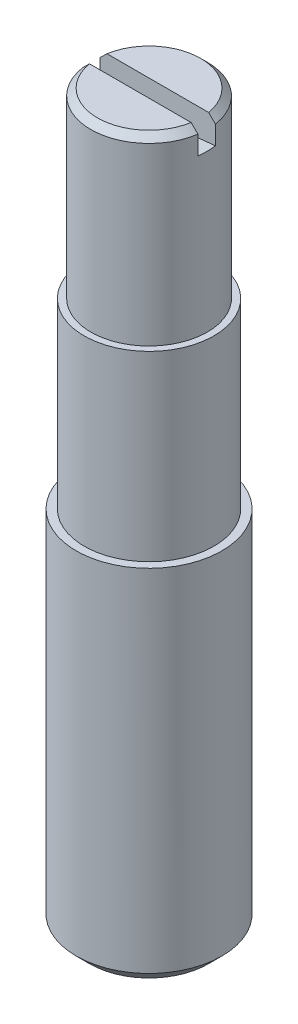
ISO-10303-21;
HEADER;
FILE_DESCRIPTION(('STEP AP214'),'2;1');
FILE_NAME('part.step','',(''),(''),'','','');
FILE_SCHEMA(('AUTOMOTIVE_DESIGN { 1 0 10303 214 1 1 1 1 }'));
ENDSEC;
DATA;
#1=APPLICATION_CONTEXT('core data for automotive mechanical design processes');
#2=APPLICATION_PROTOCOL_DEFINITION('international standard','automotive_design',2000,#1);
#3=PRODUCT_CONTEXT('',#1,'mechanical');
#4=PRODUCT('Part','Part','',(#3));
#5=PRODUCT_RELATED_PRODUCT_CATEGORY('part','',(#4));
#6=PRODUCT_DEFINITION_FORMATION('','',#4);
#7=PRODUCT_DEFINITION_CONTEXT('part definition',#1,'design');
#8=PRODUCT_DEFINITION('design','',#6,#7);
#9=PRODUCT_DEFINITION_SHAPE('','',#8);
#10=(LENGTH_UNIT() NAMED_UNIT(*) SI_UNIT(.MILLI.,.METRE.));
#11=(NAMED_UNIT(*) PLANE_ANGLE_UNIT() SI_UNIT($,.RADIAN.));
#12=(NAMED_UNIT(*) SI_UNIT($,.STERADIAN.) SOLID_ANGLE_UNIT());
#13=UNCERTAINTY_MEASURE_WITH_UNIT(LENGTH_MEASURE(1.E-05),#10,'distance_accuracy_value','');
#14=(GEOMETRIC_REPRESENTATION_CONTEXT(3) GLOBAL_UNCERTAINTY_ASSIGNED_CONTEXT((#13)) GLOBAL_UNIT_ASSIGNED_CONTEXT((#10,
#11,#12)) REPRESENTATION_CONTEXT('',''));
#15=CARTESIAN_POINT('',(0.,0.,0.));
#16=DIRECTION('',(0.,0.,1.));
#17=DIRECTION('',(1.,0.,0.));
#18=AXIS2_PLACEMENT_3D('',#15,#16,#17);
#19=CARTESIAN_POINT('',(0.,79.5,0.6));
#20=DIRECTION('',(0.,0.,-1.));
#21=DIRECTION('',(-1.,0.,0.));
#22=AXIS2_PLACEMENT_3D('',#19,#20,#21);
#23=CYLINDRICAL_SURFACE('',#22,31.5);
#24=CARTESIAN_POINT('',(3.95474398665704,48.2492400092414,-0.6));
#25=CARTESIAN_POINT('',(3.96984984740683,48.2511544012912,-0.500484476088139));
#26=CARTESIAN_POINT('',(3.98118553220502,48.2525972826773,-0.40038868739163));
#27=CARTESIAN_POINT('',(3.9962389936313,48.2545175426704,-0.20019306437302));
#28=CARTESIAN_POINT('',(4.,48.2550004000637,-0.10009653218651));
#29=CARTESIAN_POINT('',(4.,48.2550004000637,0.10009653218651));
#30=CARTESIAN_POINT('',(3.9962389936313,48.2545175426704,0.20019306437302));
#31=CARTESIAN_POINT('',(3.98118553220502,48.2525972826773,0.40038868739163));
#32=CARTESIAN_POINT('',(3.96984984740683,48.2511544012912,0.500484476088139));
#33=CARTESIAN_POINT('',(3.95474398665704,48.2492400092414,0.6));
#34=B_SPLINE_CURVE_WITH_KNOTS('',3,(#24,#25,#26,#27,#28,#29,#30,#31,#32,#33),.UNSPECIFIED.,.F.,
.F.,(4,2,2,2,4),(0.,0.301946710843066,0.602165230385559,0.902383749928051,1.20433046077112),.UNSPECIFIED.);
#35=CARTESIAN_POINT('',(3.95474398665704,48.2492400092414,-0.6));
#36=VERTEX_POINT('',#35);
#37=CARTESIAN_POINT('',(3.95474398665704,48.2492400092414,0.6));
#38=VERTEX_POINT('',#37);
#39=EDGE_CURVE('E83',#36,#38,#34,.T.);
#40=ORIENTED_EDGE('',*,*,#39,.F.);
#41=CARTESIAN_POINT('',(0.,79.5,-0.6));
#42=DIRECTION('',(0.,0.,-1.));
#43=DIRECTION('',(-1.,0.,0.));
#44=AXIS2_PLACEMENT_3D('',#41,#42,#43);
#45=CIRCLE('',#44,31.5);
#46=CARTESIAN_POINT('',(-3.95474398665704,48.2492400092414,-0.6));
#47=VERTEX_POINT('',#46);
#48=EDGE_CURVE('E89',#47,#36,#45,.F.);
#49=ORIENTED_EDGE('',*,*,#48,.F.);
#50=CARTESIAN_POINT('',(-3.95474398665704,48.2492400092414,0.6));
#51=CARTESIAN_POINT('',(-3.96984984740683,48.2511544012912,0.500484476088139));
#52=CARTESIAN_POINT('',(-3.98118553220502,48.2525972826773,0.40038868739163));
#53=CARTESIAN_POINT('',(-3.9962389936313,48.2545175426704,0.20019306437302));
#54=CARTESIAN_POINT('',(-4.,48.2550004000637,0.10009653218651));
#55=CARTESIAN_POINT('',(-4.,48.2550004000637,-0.10009653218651));
#56=CARTESIAN_POINT('',(-3.9962389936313,48.2545175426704,-0.20019306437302));
#57=CARTESIAN_POINT('',(-3.98118553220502,48.2525972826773,-0.40038868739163));
#58=CARTESIAN_POINT('',(-3.96984984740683,48.2511544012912,-0.500484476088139));
#59=CARTESIAN_POINT('',(-3.95474398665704,48.2492400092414,-0.6));
#60=B_SPLINE_CURVE_WITH_KNOTS('',3,(#50,#51,#52,#53,#54,#55,#56,#57,#58,#59),.UNSPECIFIED.,.F.,
.F.,(4,2,2,2,4),(0.,0.301946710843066,0.602165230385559,0.902383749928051,1.20433046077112),.UNSPECIFIED.);
#61=CARTESIAN_POINT('',(-3.95474398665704,48.2492400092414,0.6));
#62=VERTEX_POINT('',#61);
#63=EDGE_CURVE('E19',#62,#47,#60,.T.);
#64=ORIENTED_EDGE('',*,*,#63,.F.);
#65=CARTESIAN_POINT('',(0.,79.5,0.6));
#66=DIRECTION('',(0.,0.,-1.));
#67=DIRECTION('',(-1.,0.,0.));
#68=AXIS2_PLACEMENT_3D('',#65,#66,#67);
#69=CIRCLE('',#68,31.5);
#70=EDGE_CURVE('E82',#62,#38,#69,.F.);
#71=ORIENTED_EDGE('',*,*,#70,.T.);
#72=EDGE_LOOP('',(#40,#49,#64,#71));
#73=FACE_BOUND('',#72,.T.);
#74=ADVANCED_FACE('F15',(#73),#23,.F.);
#75=CARTESIAN_POINT('',(0.,79.5,0.6));
#76=DIRECTION('',(0.,0.,1.));
#77=DIRECTION('',(1.,0.,0.));
#78=AXIS2_PLACEMENT_3D('',#75,#76,#77);
#79=PLANE('',#78);
#80=DIRECTION('',(1.,0.,0.));
#81=VECTOR('',#80,1.);
#82=CARTESIAN_POINT('',(0.,50.,0.6));
#83=LINE('',#82,#81);
#84=CARTESIAN_POINT('',(-3.48878202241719,50.0000000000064,0.6));
#85=VERTEX_POINT('',#84);
#86=CARTESIAN_POINT('',(3.48878202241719,50.0000000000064,0.6));
#87=VERTEX_POINT('',#86);
#88=EDGE_CURVE('E160',#85,#87,#83,.T.);
#89=ORIENTED_EDGE('',*,*,#88,.T.);
#90=CARTESIAN_POINT('',(3.95474398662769,49.5399999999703,0.6));
#91=CARTESIAN_POINT('',(3.87714466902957,49.6167284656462,0.6));
#92=CARTESIAN_POINT('',(3.79951484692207,49.6934260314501,0.6));
#93=CARTESIAN_POINT('',(3.64419419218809,49.8467593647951,0.6));
#94=CARTESIAN_POINT('',(3.56650335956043,49.9233951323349,0.6));
#95=CARTESIAN_POINT('',(3.48878202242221,50.0000000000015,0.6));
#96=B_SPLINE_CURVE_WITH_KNOTS('',3,(#90,#91,#92,#93,#94,#95),.UNSPECIFIED.,.F.,.F.,(4,2,4),(0.,
0.327383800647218,0.654767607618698),.UNSPECIFIED.);
#97=CARTESIAN_POINT('',(3.95474398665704,49.5399999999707,0.6));
#98=VERTEX_POINT('',#97);
#99=EDGE_CURVE('E96',#98,#87,#96,.T.);
#100=ORIENTED_EDGE('',*,*,#99,.F.);
#101=DIRECTION('',(0.,1.,0.));
#102=VECTOR('',#101,1.);
#103=CARTESIAN_POINT('',(3.95474398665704,79.5,0.6));
#104=LINE('',#103,#102);
#105=EDGE_CURVE('E94',#38,#98,#104,.T.);
#106=ORIENTED_EDGE('',*,*,#105,.F.);
#107=ORIENTED_EDGE('',*,*,#70,.F.);
#108=DIRECTION('',(0.,1.,0.));
#109=VECTOR('',#108,1.);
#110=CARTESIAN_POINT('',(-3.95474398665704,79.5,0.6));
#111=LINE('',#110,#109);
#112=CARTESIAN_POINT('',(-3.95474398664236,49.5399999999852,0.6));
#113=VERTEX_POINT('',#112);
#114=EDGE_CURVE('E73',#113,#62,#111,.F.);
#115=ORIENTED_EDGE('',*,*,#114,.F.);
#116=CARTESIAN_POINT('',(-3.48878202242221,50.0000000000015,0.6));
#117=CARTESIAN_POINT('',(-3.56650335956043,49.9233951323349,0.6));
#118=CARTESIAN_POINT('',(-3.64419419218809,49.8467593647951,0.6));
#119=CARTESIAN_POINT('',(-3.79951484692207,49.6934260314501,0.6));
#120=CARTESIAN_POINT('',(-3.87714466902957,49.6167284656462,0.6));
#121=CARTESIAN_POINT('',(-3.95474398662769,49.5399999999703,0.6));
#122=B_SPLINE_CURVE_WITH_KNOTS('',3,(#116,#117,#118,#119,#120,#121),.UNSPECIFIED.,.F.,.F.,(4,2,
4),(0.,0.327383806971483,0.654767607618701),.UNSPECIFIED.);
#123=EDGE_CURVE('E148',#85,#113,#122,.T.);
#124=ORIENTED_EDGE('',*,*,#123,.F.);
#125=EDGE_LOOP('',(#89,#100,#106,#107,#115,#124));
#126=FACE_BOUND('',#125,.T.);
#127=ADVANCED_FACE('F92',(#126),#79,.F.);
#128=CARTESIAN_POINT('',(0.,79.5,-0.6));
#129=DIRECTION('',(0.,0.,1.));
#130=DIRECTION('',(1.,0.,0.));
#131=AXIS2_PLACEMENT_3D('',#128,#129,#130);
#132=PLANE('',#131);
#133=DIRECTION('',(1.,0.,0.));
#134=VECTOR('',#133,1.);
#135=CARTESIAN_POINT('',(0.,50.,-0.6));
#136=LINE('',#135,#134);
#137=CARTESIAN_POINT('',(3.48878202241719,50.0000000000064,-0.6));
#138=VERTEX_POINT('',#137);
#139=CARTESIAN_POINT('',(-3.48878202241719,50.0000000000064,-0.6));
#140=VERTEX_POINT('',#139);
#141=EDGE_CURVE('E162',#138,#140,#136,.F.);
#142=ORIENTED_EDGE('',*,*,#141,.T.);
#143=CARTESIAN_POINT('',(-3.48878202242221,50.0000000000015,-0.6));
#144=CARTESIAN_POINT('',(-3.56650335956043,49.9233951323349,-0.6));
#145=CARTESIAN_POINT('',(-3.64419419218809,49.8467593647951,-0.6));
#146=CARTESIAN_POINT('',(-3.79951484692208,49.6934260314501,-0.6));
#147=CARTESIAN_POINT('',(-3.87714466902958,49.6167284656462,-0.6));
#148=CARTESIAN_POINT('',(-3.9547439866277,49.5399999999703,-0.6));
#149=B_SPLINE_CURVE_WITH_KNOTS('',3,(#143,#144,#145,#146,#147,#148),.UNSPECIFIED.,.F.,.F.,(4,2,
4),(0.,0.327383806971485,0.654767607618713),.UNSPECIFIED.);
#150=CARTESIAN_POINT('',(-3.95474398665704,49.5399999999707,-0.6));
#151=VERTEX_POINT('',#150);
#152=EDGE_CURVE('E39',#140,#151,#149,.T.);
#153=ORIENTED_EDGE('',*,*,#152,.T.);
#154=DIRECTION('',(0.,1.,0.));
#155=VECTOR('',#154,1.);
#156=CARTESIAN_POINT('',(-3.95474398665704,79.5,-0.6));
#157=LINE('',#156,#155);
#158=EDGE_CURVE('E153',#151,#47,#157,.F.);
#159=ORIENTED_EDGE('',*,*,#158,.T.);
#160=ORIENTED_EDGE('',*,*,#48,.T.);
#161=DIRECTION('',(0.,1.,0.));
#162=VECTOR('',#161,1.);
#163=CARTESIAN_POINT('',(3.95474398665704,79.5,-0.6));
#164=LINE('',#163,#162);
#165=CARTESIAN_POINT('',(3.95474398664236,49.5399999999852,-0.6));
#166=VERTEX_POINT('',#165);
#167=EDGE_CURVE('E137',#36,#166,#164,.T.);
#168=ORIENTED_EDGE('',*,*,#167,.T.);
#169=CARTESIAN_POINT('',(3.95474398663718,49.5399999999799,-0.600000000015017));
#170=CARTESIAN_POINT('',(3.87714466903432,49.616728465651,-0.600000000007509));
#171=CARTESIAN_POINT('',(3.79951484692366,49.6934260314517,-0.600000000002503));
#172=CARTESIAN_POINT('',(3.64419419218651,49.8467593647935,-0.599999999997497));
#173=CARTESIAN_POINT('',(3.56650335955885,49.9233951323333,-0.599999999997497));
#174=CARTESIAN_POINT('',(3.48878202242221,50.0000000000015,-0.6));
#175=B_SPLINE_CURVE_WITH_KNOTS('',3,(#169,#170,#171,#172,#173,#174),.UNSPECIFIED.,.F.,.F.,(4,2,
4),(0.,0.327383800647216,0.654767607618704),.UNSPECIFIED.);
#176=EDGE_CURVE('E131',#166,#138,#175,.T.);
#177=ORIENTED_EDGE('',*,*,#176,.T.);
#178=EDGE_LOOP('',(#142,#153,#159,#160,#168,#177));
#179=FACE_BOUND('',#178,.T.);
#180=ADVANCED_FACE('F138',(#179),#132,.T.);
#181=CARTESIAN_POINT('',(0.,50.,0.));
#182=DIRECTION('',(0.,-1.,0.));
#183=DIRECTION('',(0.,0.,-1.));
#184=AXIS2_PLACEMENT_3D('',#181,#182,#183);
#185=PLANE('',#184);
#186=ORIENTED_EDGE('',*,*,#88,.F.);
#187=CARTESIAN_POINT('',(0.,50.0000000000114,0.));
#188=DIRECTION('',(0.,-1.,0.));
#189=DIRECTION('',(0.,0.,-1.));
#190=AXIS2_PLACEMENT_3D('',#187,#188,#189);
#191=CIRCLE('',#190,3.53999999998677);
#192=EDGE_CURVE('E158',#87,#85,#191,.T.);
#193=ORIENTED_EDGE('',*,*,#192,.F.);
#194=EDGE_LOOP('',(#186,#193));
#195=FACE_BOUND('',#194,.T.);
#196=ADVANCED_FACE('F142',(#195),#185,.F.);
#197=CARTESIAN_POINT('',(0.,50.,0.));
#198=DIRECTION('',(0.,-1.,0.));
#199=DIRECTION('',(0.,0.,-1.));
#200=AXIS2_PLACEMENT_3D('',#197,#198,#199);
#201=PLANE('',#200);
#202=CARTESIAN_POINT('',(0.,50.0000000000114,0.));
#203=DIRECTION('',(0.,-1.,0.));
#204=DIRECTION('',(0.,0.,-1.));
#205=AXIS2_PLACEMENT_3D('',#202,#203,#204);
#206=CIRCLE('',#205,3.53999999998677);
#207=EDGE_CURVE('E164',#140,#138,#206,.T.);
#208=ORIENTED_EDGE('',*,*,#207,.F.);
#209=ORIENTED_EDGE('',*,*,#141,.F.);
#210=EDGE_LOOP('',(#208,#209));
#211=FACE_BOUND('',#210,.T.);
#212=ADVANCED_FACE('F284',(#211),#201,.F.);
#213=CARTESIAN_POINT('',(0.,49.5399999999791,0.));
#214=DIRECTION('',(0.,-1.,0.));
#215=DIRECTION('',(0.,0.,-1.));
#216=AXIS2_PLACEMENT_3D('',#213,#214,#215);
#217=CONICAL_SURFACE('',#216,3.99999999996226,0.785398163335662);
#218=ORIENTED_EDGE('',*,*,#192,.T.);
#219=ORIENTED_EDGE('',*,*,#123,.T.);
#220=CARTESIAN_POINT('',(0.,49.54,0.));
#221=DIRECTION('',(0.,-1.,0.));
#222=DIRECTION('',(0.,0.,-1.));
#223=AXIS2_PLACEMENT_3D('',#220,#221,#222);
#224=CIRCLE('',#223,4.);
#225=EDGE_CURVE('E79',#98,#113,#224,.T.);
#226=ORIENTED_EDGE('',*,*,#225,.F.);
#227=ORIENTED_EDGE('',*,*,#99,.T.);
#228=EDGE_LOOP('',(#218,#219,#226,#227));
#229=FACE_BOUND('',#228,.T.);
#230=ADVANCED_FACE('F119',(#229),#217,.T.);
#231=CARTESIAN_POINT('',(0.,49.5399999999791,0.));
#232=DIRECTION('',(0.,-1.,0.));
#233=DIRECTION('',(0.,0.,-1.));
#234=AXIS2_PLACEMENT_3D('',#231,#232,#233);
#235=CONICAL_SURFACE('',#234,3.99999999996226,0.785398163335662);
#236=ORIENTED_EDGE('',*,*,#152,.F.);
#237=ORIENTED_EDGE('',*,*,#207,.T.);
#238=ORIENTED_EDGE('',*,*,#176,.F.);
#239=CARTESIAN_POINT('',(0.,49.54,0.));
#240=DIRECTION('',(0.,-1.,0.));
#241=DIRECTION('',(0.,0.,-1.));
#242=AXIS2_PLACEMENT_3D('',#239,#240,#241);
#243=CIRCLE('',#242,4.);
#244=EDGE_CURVE('E174',#151,#166,#243,.T.);
#245=ORIENTED_EDGE('',*,*,#244,.F.);
#246=EDGE_LOOP('',(#236,#237,#238,#245));
#247=FACE_BOUND('',#246,.T.);
#248=ADVANCED_FACE('F114',(#247),#235,.T.);
#249=CARTESIAN_POINT('',(0.,37.5,0.));
#250=DIRECTION('',(0.,-1.,0.));
#251=DIRECTION('',(0.,0.,-1.));
#252=AXIS2_PLACEMENT_3D('',#249,#250,#251);
#253=CYLINDRICAL_SURFACE('',#252,4.);
#254=ORIENTED_EDGE('',*,*,#39,.T.);
#255=ORIENTED_EDGE('',*,*,#105,.T.);
#256=ORIENTED_EDGE('',*,*,#225,.T.);
#257=ORIENTED_EDGE('',*,*,#114,.T.);
#258=ORIENTED_EDGE('',*,*,#63,.T.);
#259=ORIENTED_EDGE('',*,*,#158,.F.);
#260=ORIENTED_EDGE('',*,*,#244,.T.);
#261=ORIENTED_EDGE('',*,*,#167,.F.);
#262=EDGE_LOOP('',(#254,#255,#256,#257,#258,#259,#260,#261));
#263=FACE_BOUND('',#262,.T.);
#264=CARTESIAN_POINT('',(0.,37.5,0.));
#265=DIRECTION('',(0.,-1.,0.));
#266=DIRECTION('',(0.,0.,-1.));
#267=AXIS2_PLACEMENT_3D('',#264,#265,#266);
#268=CIRCLE('',#267,4.);
#269=CARTESIAN_POINT('',(0.,37.5,-4.));
#270=VERTEX_POINT('',#269);
#271=EDGE_CURVE('E170',#270,#270,#268,.F.);
#272=ORIENTED_EDGE('',*,*,#271,.T.);
#273=EDGE_LOOP('',(#272));
#274=FACE_BOUND('',#273,.T.);
#275=ADVANCED_FACE('F75',(#263,#274),#253,.T.);
#276=CARTESIAN_POINT('',(0.,37.5,0.));
#277=DIRECTION('',(0.,-1.,0.));
#278=DIRECTION('',(0.,0.,-1.));
#279=AXIS2_PLACEMENT_3D('',#276,#277,#278);
#280=PLANE('',#279);
#281=ORIENTED_EDGE('',*,*,#271,.F.);
#282=EDGE_LOOP('',(#281));
#283=FACE_BOUND('',#282,.T.);
#284=CARTESIAN_POINT('',(0.,37.5,0.));
#285=DIRECTION('',(0.,-1.,0.));
#286=DIRECTION('',(0.,0.,-1.));
#287=AXIS2_PLACEMENT_3D('',#284,#285,#286);
#288=CIRCLE('',#287,4.45);
#289=CARTESIAN_POINT('',(0.,37.5,-4.45));
#290=VERTEX_POINT('',#289);
#291=EDGE_CURVE('E173',#290,#290,#288,.T.);
#292=ORIENTED_EDGE('',*,*,#291,.F.);
#293=EDGE_LOOP('',(#292));
#294=FACE_BOUND('',#293,.T.);
#295=ADVANCED_FACE('F113',(#283,#294),#280,.F.);
#296=CARTESIAN_POINT('',(4.08,0.,0.));
#297=DIRECTION('',(0.,1.,0.));
#298=DIRECTION('',(0.,0.,1.));
#299=AXIS2_PLACEMENT_3D('',#296,#297,#298);
#300=PLANE('',#299);
#301=CARTESIAN_POINT('',(0.,5.6843418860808E-11,0.));
#302=DIRECTION('',(0.,1.,0.));
#303=DIRECTION('',(0.,0.,1.));
#304=AXIS2_PLACEMENT_3D('',#301,#302,#303);
#305=CIRCLE('',#304,4.07999999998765);
#306=CARTESIAN_POINT('',(0.,5.6843418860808E-11,4.07999999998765));
#307=VERTEX_POINT('',#306);
#308=EDGE_CURVE('E179',#307,#307,#305,.T.);
#309=ORIENTED_EDGE('',*,*,#308,.F.);
#310=EDGE_LOOP('',(#309));
#311=FACE_BOUND('',#310,.T.);
#312=ADVANCED_FACE('F211',(#311),#300,.F.);
#313=CARTESIAN_POINT('',(0.,25.,0.));
#314=DIRECTION('',(0.,-1.,0.));
#315=DIRECTION('',(0.,0.,-1.));
#316=AXIS2_PLACEMENT_3D('',#313,#314,#315);
#317=CYLINDRICAL_SURFACE('',#316,4.45);
#318=ORIENTED_EDGE('',*,*,#291,.T.);
#319=EDGE_LOOP('',(#318));
#320=FACE_BOUND('',#319,.T.);
#321=CARTESIAN_POINT('',(0.,25.,0.));
#322=DIRECTION('',(0.,-1.,0.));
#323=DIRECTION('',(0.,0.,-1.));
#324=AXIS2_PLACEMENT_3D('',#321,#322,#323);
#325=CIRCLE('',#324,4.45);
#326=CARTESIAN_POINT('',(0.,25.,-4.45));
#327=VERTEX_POINT('',#326);
#328=EDGE_CURVE('E184',#327,#327,#325,.F.);
#329=ORIENTED_EDGE('',*,*,#328,.T.);
#330=EDGE_LOOP('',(#329));
#331=FACE_BOUND('',#330,.T.);
#332=ADVANCED_FACE('F207',(#320,#331),#317,.T.);
#333=CARTESIAN_POINT('',(0.,0.920000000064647,0.));
#334=DIRECTION('',(0.,1.,0.));
#335=DIRECTION('',(0.,0.,1.));
#336=AXIS2_PLACEMENT_3D('',#333,#334,#335);
#337=CONICAL_SURFACE('',#336,4.99999999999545,0.785398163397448);
#338=CARTESIAN_POINT('',(0.,0.92,0.));
#339=DIRECTION('',(0.,-1.,0.));
#340=DIRECTION('',(0.,0.,-1.));
#341=AXIS2_PLACEMENT_3D('',#338,#339,#340);
#342=CIRCLE('',#341,5.);
#343=CARTESIAN_POINT('',(0.,0.92,-5.));
#344=VERTEX_POINT('',#343);
#345=EDGE_CURVE('E30',#344,#344,#342,.F.);
#346=ORIENTED_EDGE('',*,*,#345,.F.);
#347=EDGE_LOOP('',(#346));
#348=FACE_BOUND('',#347,.T.);
#349=ORIENTED_EDGE('',*,*,#308,.T.);
#350=EDGE_LOOP('',(#349));
#351=FACE_BOUND('',#350,.T.);
#352=ADVANCED_FACE('F203',(#348,#351),#337,.T.);
#353=CARTESIAN_POINT('',(0.,25.,0.));
#354=DIRECTION('',(0.,-1.,0.));
#355=DIRECTION('',(0.,0.,-1.));
#356=AXIS2_PLACEMENT_3D('',#353,#354,#355);
#357=PLANE('',#356);
#358=ORIENTED_EDGE('',*,*,#328,.F.);
#359=EDGE_LOOP('',(#358));
#360=FACE_BOUND('',#359,.T.);
#361=CARTESIAN_POINT('',(0.,25.,0.));
#362=DIRECTION('',(0.,-1.,0.));
#363=DIRECTION('',(0.,0.,-1.));
#364=AXIS2_PLACEMENT_3D('',#361,#362,#363);
#365=CIRCLE('',#364,5.);
#366=CARTESIAN_POINT('',(0.,25.,-5.));
#367=VERTEX_POINT('',#366);
#368=EDGE_CURVE('E10',#367,#367,#365,.T.);
#369=ORIENTED_EDGE('',*,*,#368,.F.);
#370=EDGE_LOOP('',(#369));
#371=FACE_BOUND('',#370,.T.);
#372=ADVANCED_FACE('F206',(#360,#371),#357,.F.);
#373=CARTESIAN_POINT('',(0.,0.,0.));
#374=DIRECTION('',(0.,-1.,0.));
#375=DIRECTION('',(0.,0.,-1.));
#376=AXIS2_PLACEMENT_3D('',#373,#374,#375);
#377=CYLINDRICAL_SURFACE('',#376,5.);
#378=ORIENTED_EDGE('',*,*,#368,.T.);
#379=EDGE_LOOP('',(#378));
#380=FACE_BOUND('',#379,.T.);
#381=ORIENTED_EDGE('',*,*,#345,.T.);
#382=EDGE_LOOP('',(#381));
#383=FACE_BOUND('',#382,.T.);
#384=ADVANCED_FACE('F201',(#380,#383),#377,.T.);
#385=CLOSED_SHELL('',(#74,#127,#180,#196,#212,#230,#248,#275,#295,#312,#332,#352,#372,#384));
#386=MANIFOLD_SOLID_BREP('B1',#385);
#387=ADVANCED_BREP_SHAPE_REPRESENTATION('',(#18,#386),#14);
#388=SHAPE_DEFINITION_REPRESENTATION(#9,#387);
ENDSEC;
END-ISO-10303-21;
